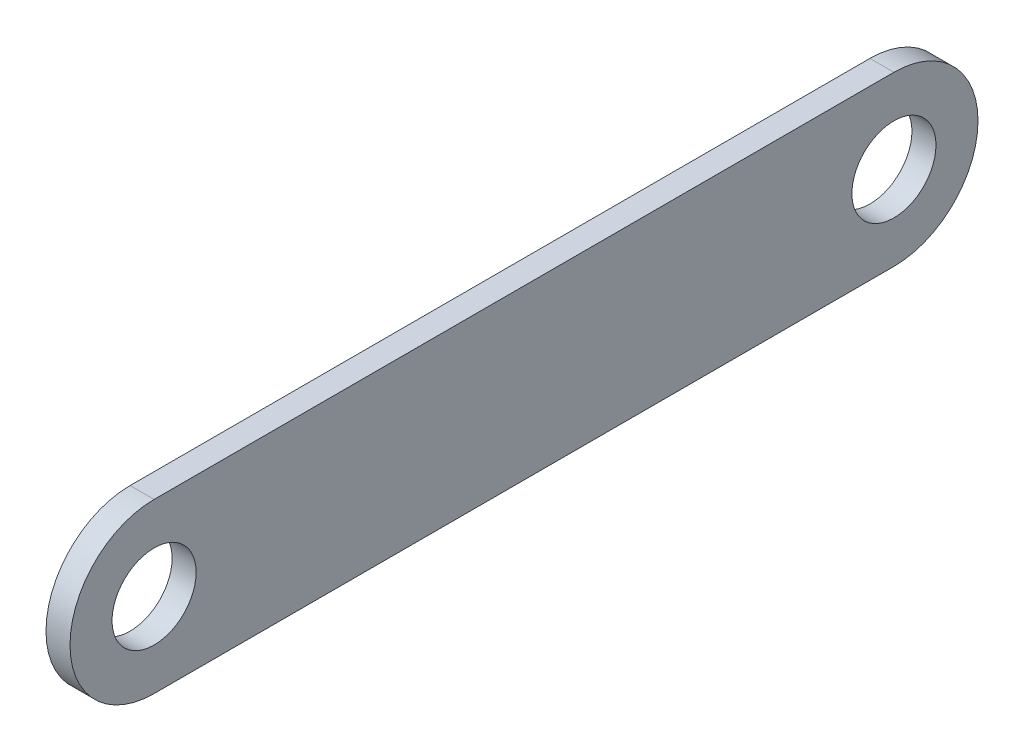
ISO-10303-21;
HEADER;
FILE_DESCRIPTION(('STEP AP214'),'2;1');
FILE_NAME('part.step','',(''),(''),'','','');
FILE_SCHEMA(('AUTOMOTIVE_DESIGN { 1 0 10303 214 1 1 1 1 }'));
ENDSEC;
DATA;
#1=APPLICATION_CONTEXT('core data for automotive mechanical design processes');
#2=APPLICATION_PROTOCOL_DEFINITION('international standard','automotive_design',2000,#1);
#3=PRODUCT_CONTEXT('',#1,'mechanical');
#4=PRODUCT('Part','Part','',(#3));
#5=PRODUCT_RELATED_PRODUCT_CATEGORY('part','',(#4));
#6=PRODUCT_DEFINITION_FORMATION('','',#4);
#7=PRODUCT_DEFINITION_CONTEXT('part definition',#1,'design');
#8=PRODUCT_DEFINITION('design','',#6,#7);
#9=PRODUCT_DEFINITION_SHAPE('','',#8);
#10=(LENGTH_UNIT() NAMED_UNIT(*) SI_UNIT(.MILLI.,.METRE.));
#11=(NAMED_UNIT(*) PLANE_ANGLE_UNIT() SI_UNIT($,.RADIAN.));
#12=(NAMED_UNIT(*) SI_UNIT($,.STERADIAN.) SOLID_ANGLE_UNIT());
#13=UNCERTAINTY_MEASURE_WITH_UNIT(LENGTH_MEASURE(1.E-05),#10,'distance_accuracy_value','');
#14=(GEOMETRIC_REPRESENTATION_CONTEXT(3) GLOBAL_UNCERTAINTY_ASSIGNED_CONTEXT((#13)) GLOBAL_UNIT_ASSIGNED_CONTEXT((#10,
#11,#12)) REPRESENTATION_CONTEXT('',''));
#15=CARTESIAN_POINT('',(0.,0.,0.));
#16=DIRECTION('',(0.,0.,1.));
#17=DIRECTION('',(1.,0.,0.));
#18=AXIS2_PLACEMENT_3D('',#15,#16,#17);
#19=CARTESIAN_POINT('',(10.,0.,-308.));
#20=DIRECTION('',(1.,0.,0.));
#21=DIRECTION('',(0.,0.,-1.));
#22=AXIS2_PLACEMENT_3D('',#19,#20,#21);
#23=PLANE('',#22);
#24=CARTESIAN_POINT('',(10.,0.,0.));
#25=DIRECTION('',(1.,0.,0.));
#26=DIRECTION('',(0.,0.,-1.));
#27=AXIS2_PLACEMENT_3D('',#24,#25,#26);
#28=CIRCLE('',#27,17.5);
#29=CARTESIAN_POINT('',(10.,0.,-17.5));
#30=VERTEX_POINT('',#29);
#31=EDGE_CURVE('E141',#30,#30,#28,.T.);
#32=ORIENTED_EDGE('',*,*,#31,.F.);
#33=EDGE_LOOP('',(#32));
#34=FACE_BOUND('',#33,.T.);
#35=CARTESIAN_POINT('',(10.,0.,-308.));
#36=DIRECTION('',(1.,0.,0.));
#37=DIRECTION('',(0.,0.,-1.));
#38=AXIS2_PLACEMENT_3D('',#35,#36,#37);
#39=CIRCLE('',#38,35.);
#40=CARTESIAN_POINT('',(10.,-35.,-308.));
#41=VERTEX_POINT('',#40);
#42=CARTESIAN_POINT('',(10.,35.,-308.));
#43=VERTEX_POINT('',#42);
#44=EDGE_CURVE('E120',#41,#43,#39,.T.);
#45=ORIENTED_EDGE('',*,*,#44,.T.);
#46=DIRECTION('',(0.,0.,1.));
#47=VECTOR('',#46,1.);
#48=CARTESIAN_POINT('',(10.,35.,-308.));
#49=LINE('',#48,#47);
#50=CARTESIAN_POINT('',(10.,35.,0.));
#51=VERTEX_POINT('',#50);
#52=EDGE_CURVE('E113',#43,#51,#49,.T.);
#53=ORIENTED_EDGE('',*,*,#52,.T.);
#54=CARTESIAN_POINT('',(10.,0.,0.));
#55=DIRECTION('',(1.,0.,0.));
#56=DIRECTION('',(0.,0.,-1.));
#57=AXIS2_PLACEMENT_3D('',#54,#55,#56);
#58=CIRCLE('',#57,35.);
#59=CARTESIAN_POINT('',(10.,-35.,0.));
#60=VERTEX_POINT('',#59);
#61=EDGE_CURVE('E119',#51,#60,#58,.T.);
#62=ORIENTED_EDGE('',*,*,#61,.T.);
#63=DIRECTION('',(0.,0.,1.));
#64=VECTOR('',#63,1.);
#65=CARTESIAN_POINT('',(10.,-35.,-308.));
#66=LINE('',#65,#64);
#67=EDGE_CURVE('E132',#41,#60,#66,.T.);
#68=ORIENTED_EDGE('',*,*,#67,.F.);
#69=EDGE_LOOP('',(#45,#53,#62,#68));
#70=FACE_BOUND('',#69,.T.);
#71=CARTESIAN_POINT('',(10.,0.,-308.));
#72=DIRECTION('',(1.,0.,0.));
#73=DIRECTION('',(0.,0.,-1.));
#74=AXIS2_PLACEMENT_3D('',#71,#72,#73);
#75=CIRCLE('',#74,17.5);
#76=CARTESIAN_POINT('',(10.,0.,-325.5));
#77=VERTEX_POINT('',#76);
#78=EDGE_CURVE('E161',#77,#77,#75,.T.);
#79=ORIENTED_EDGE('',*,*,#78,.F.);
#80=EDGE_LOOP('',(#79));
#81=FACE_BOUND('',#80,.T.);
#82=ADVANCED_FACE('F69',(#34,#70,#81),#23,.T.);
#83=CARTESIAN_POINT('',(0.,0.,-308.));
#84=DIRECTION('',(1.,0.,0.));
#85=DIRECTION('',(0.,0.,-1.));
#86=AXIS2_PLACEMENT_3D('',#83,#84,#85);
#87=PLANE('',#86);
#88=CARTESIAN_POINT('',(0.,0.,-308.));
#89=DIRECTION('',(1.,0.,0.));
#90=DIRECTION('',(0.,0.,-1.));
#91=AXIS2_PLACEMENT_3D('',#88,#89,#90);
#92=CIRCLE('',#91,35.);
#93=CARTESIAN_POINT('',(0.,-35.,-308.));
#94=VERTEX_POINT('',#93);
#95=CARTESIAN_POINT('',(0.,35.,-308.));
#96=VERTEX_POINT('',#95);
#97=EDGE_CURVE('E138',#94,#96,#92,.T.);
#98=ORIENTED_EDGE('',*,*,#97,.F.);
#99=DIRECTION('',(0.,0.,1.));
#100=VECTOR('',#99,1.);
#101=CARTESIAN_POINT('',(0.,-35.,-308.));
#102=LINE('',#101,#100);
#103=CARTESIAN_POINT('',(0.,-35.,0.));
#104=VERTEX_POINT('',#103);
#105=EDGE_CURVE('E147',#94,#104,#102,.T.);
#106=ORIENTED_EDGE('',*,*,#105,.T.);
#107=CARTESIAN_POINT('',(0.,0.,0.));
#108=DIRECTION('',(1.,0.,0.));
#109=DIRECTION('',(0.,0.,-1.));
#110=AXIS2_PLACEMENT_3D('',#107,#108,#109);
#111=CIRCLE('',#110,35.);
#112=CARTESIAN_POINT('',(0.,35.,0.));
#113=VERTEX_POINT('',#112);
#114=EDGE_CURVE('E144',#113,#104,#111,.T.);
#115=ORIENTED_EDGE('',*,*,#114,.F.);
#116=DIRECTION('',(0.,0.,1.));
#117=VECTOR('',#116,1.);
#118=CARTESIAN_POINT('',(0.,35.,-308.));
#119=LINE('',#118,#117);
#120=EDGE_CURVE('E126',#96,#113,#119,.T.);
#121=ORIENTED_EDGE('',*,*,#120,.F.);
#122=EDGE_LOOP('',(#98,#106,#115,#121));
#123=FACE_BOUND('',#122,.T.);
#124=CARTESIAN_POINT('',(0.,0.,0.));
#125=DIRECTION('',(1.,0.,0.));
#126=DIRECTION('',(0.,0.,-1.));
#127=AXIS2_PLACEMENT_3D('',#124,#125,#126);
#128=CIRCLE('',#127,17.5);
#129=CARTESIAN_POINT('',(0.,0.,-17.5));
#130=VERTEX_POINT('',#129);
#131=EDGE_CURVE('E157',#130,#130,#128,.T.);
#132=ORIENTED_EDGE('',*,*,#131,.T.);
#133=EDGE_LOOP('',(#132));
#134=FACE_BOUND('',#133,.T.);
#135=CARTESIAN_POINT('',(0.,0.,-308.));
#136=DIRECTION('',(1.,0.,0.));
#137=DIRECTION('',(0.,0.,-1.));
#138=AXIS2_PLACEMENT_3D('',#135,#136,#137);
#139=CIRCLE('',#138,17.5);
#140=CARTESIAN_POINT('',(0.,0.,-325.5));
#141=VERTEX_POINT('',#140);
#142=EDGE_CURVE('E165',#141,#141,#139,.T.);
#143=ORIENTED_EDGE('',*,*,#142,.T.);
#144=EDGE_LOOP('',(#143));
#145=FACE_BOUND('',#144,.T.);
#146=ADVANCED_FACE('F176',(#123,#134,#145),#87,.F.);
#147=CARTESIAN_POINT('',(10.,0.,-308.));
#148=DIRECTION('',(-1.,0.,0.));
#149=DIRECTION('',(0.,0.,1.));
#150=AXIS2_PLACEMENT_3D('',#147,#148,#149);
#151=CYLINDRICAL_SURFACE('',#150,35.);
#152=ORIENTED_EDGE('',*,*,#97,.T.);
#153=DIRECTION('',(-1.,0.,0.));
#154=VECTOR('',#153,1.);
#155=CARTESIAN_POINT('',(10.,35.,-308.));
#156=LINE('',#155,#154);
#157=EDGE_CURVE('E12',#43,#96,#156,.T.);
#158=ORIENTED_EDGE('',*,*,#157,.F.);
#159=ORIENTED_EDGE('',*,*,#44,.F.);
#160=DIRECTION('',(-1.,0.,0.));
#161=VECTOR('',#160,1.);
#162=CARTESIAN_POINT('',(10.,-35.,-308.));
#163=LINE('',#162,#161);
#164=EDGE_CURVE('E87',#41,#94,#163,.T.);
#165=ORIENTED_EDGE('',*,*,#164,.T.);
#166=EDGE_LOOP('',(#152,#158,#159,#165));
#167=FACE_BOUND('',#166,.T.);
#168=ADVANCED_FACE('F71',(#167),#151,.T.);
#169=CARTESIAN_POINT('',(10.,35.,-308.));
#170=DIRECTION('',(0.,-1.,0.));
#171=DIRECTION('',(0.,0.,-1.));
#172=AXIS2_PLACEMENT_3D('',#169,#170,#171);
#173=PLANE('',#172);
#174=ORIENTED_EDGE('',*,*,#120,.T.);
#175=DIRECTION('',(-1.,0.,0.));
#176=VECTOR('',#175,1.);
#177=CARTESIAN_POINT('',(10.,35.,0.));
#178=LINE('',#177,#176);
#179=EDGE_CURVE('E79',#51,#113,#178,.T.);
#180=ORIENTED_EDGE('',*,*,#179,.F.);
#181=ORIENTED_EDGE('',*,*,#52,.F.);
#182=ORIENTED_EDGE('',*,*,#157,.T.);
#183=EDGE_LOOP('',(#174,#180,#181,#182));
#184=FACE_BOUND('',#183,.T.);
#185=ADVANCED_FACE('F125',(#184),#173,.F.);
#186=CARTESIAN_POINT('',(10.,0.,0.));
#187=DIRECTION('',(-1.,0.,0.));
#188=DIRECTION('',(0.,0.,1.));
#189=AXIS2_PLACEMENT_3D('',#186,#187,#188);
#190=CYLINDRICAL_SURFACE('',#189,35.);
#191=ORIENTED_EDGE('',*,*,#114,.T.);
#192=DIRECTION('',(-1.,0.,0.));
#193=VECTOR('',#192,1.);
#194=CARTESIAN_POINT('',(10.,-35.,0.));
#195=LINE('',#194,#193);
#196=EDGE_CURVE('E102',#60,#104,#195,.T.);
#197=ORIENTED_EDGE('',*,*,#196,.F.);
#198=ORIENTED_EDGE('',*,*,#61,.F.);
#199=ORIENTED_EDGE('',*,*,#179,.T.);
#200=EDGE_LOOP('',(#191,#197,#198,#199));
#201=FACE_BOUND('',#200,.T.);
#202=ADVANCED_FACE('F130',(#201),#190,.T.);
#203=CARTESIAN_POINT('',(10.,-35.,-308.));
#204=DIRECTION('',(0.,-1.,0.));
#205=DIRECTION('',(0.,0.,-1.));
#206=AXIS2_PLACEMENT_3D('',#203,#204,#205);
#207=PLANE('',#206);
#208=ORIENTED_EDGE('',*,*,#105,.F.);
#209=ORIENTED_EDGE('',*,*,#164,.F.);
#210=ORIENTED_EDGE('',*,*,#67,.T.);
#211=ORIENTED_EDGE('',*,*,#196,.T.);
#212=EDGE_LOOP('',(#208,#209,#210,#211));
#213=FACE_BOUND('',#212,.T.);
#214=ADVANCED_FACE('F188',(#213),#207,.T.);
#215=CARTESIAN_POINT('',(10.,0.,0.));
#216=DIRECTION('',(-1.,0.,0.));
#217=DIRECTION('',(0.,0.,1.));
#218=AXIS2_PLACEMENT_3D('',#215,#216,#217);
#219=CYLINDRICAL_SURFACE('',#218,17.5);
#220=ORIENTED_EDGE('',*,*,#31,.T.);
#221=EDGE_LOOP('',(#220));
#222=FACE_BOUND('',#221,.T.);
#223=ORIENTED_EDGE('',*,*,#131,.F.);
#224=EDGE_LOOP('',(#223));
#225=FACE_BOUND('',#224,.T.);
#226=ADVANCED_FACE('F185',(#222,#225),#219,.F.);
#227=CARTESIAN_POINT('',(10.,0.,-308.));
#228=DIRECTION('',(-1.,0.,0.));
#229=DIRECTION('',(0.,0.,1.));
#230=AXIS2_PLACEMENT_3D('',#227,#228,#229);
#231=CYLINDRICAL_SURFACE('',#230,17.5);
#232=ORIENTED_EDGE('',*,*,#78,.T.);
#233=EDGE_LOOP('',(#232));
#234=FACE_BOUND('',#233,.T.);
#235=ORIENTED_EDGE('',*,*,#142,.F.);
#236=EDGE_LOOP('',(#235));
#237=FACE_BOUND('',#236,.T.);
#238=ADVANCED_FACE('F173',(#234,#237),#231,.F.);
#239=CLOSED_SHELL('',(#82,#146,#168,#185,#202,#214,#226,#238));
#240=MANIFOLD_SOLID_BREP('B2',#239);
#241=ADVANCED_BREP_SHAPE_REPRESENTATION('',(#18,#240),#14);
#242=SHAPE_DEFINITION_REPRESENTATION(#9,#241);
ENDSEC;
END-ISO-10303-21;
